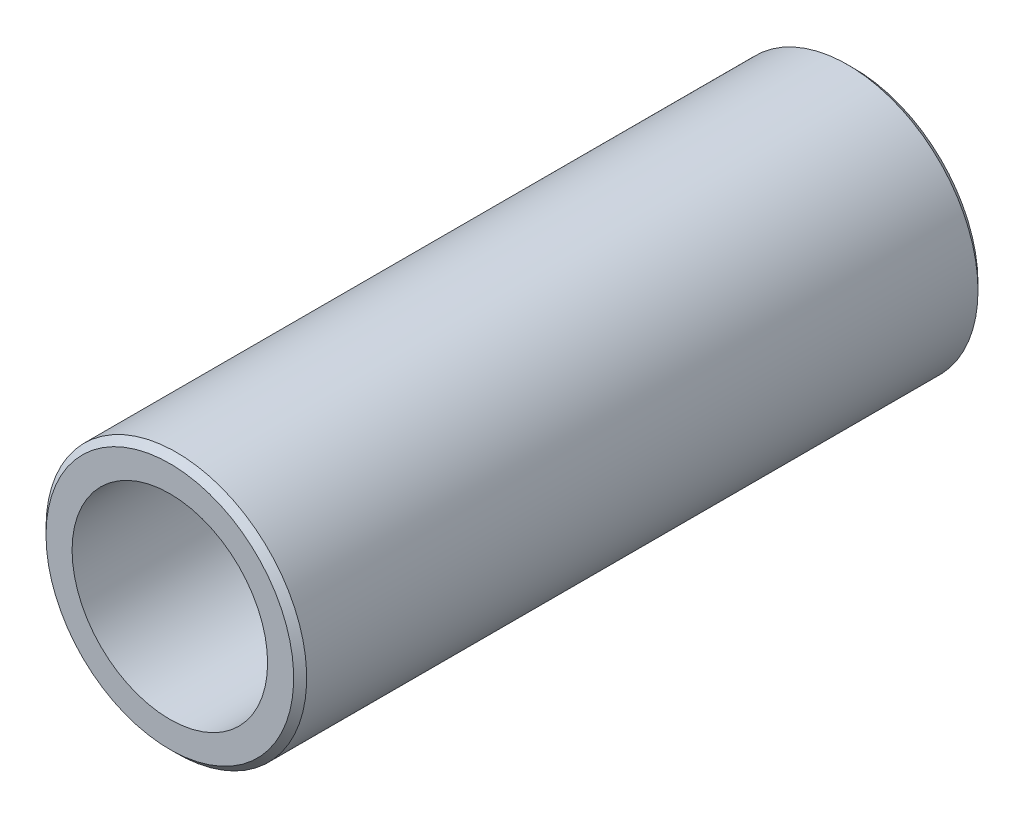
from build123d import *

# Parameters (mm, degrees)
ESQUISSE1_R        = 20
ESQUISSE1_R_2      = 15
EXTRU_MINCE1_DEPTH = 105
CHANFREIN1_SIZE    = 1


with BuildPart() as part:
    # Esquisse1 → Extru.-Mince1 (new body)
    with BuildSketch(Plane.XY):
        Circle(ESQUISSE1_R)
        Circle(ESQUISSE1_R_2, mode=Mode.SUBTRACT)
    extrude(amount=EXTRU_MINCE1_DEPTH)

    # Chanfrein1
    chanfrein1_edges = [part.edges().sort_by_distance(p)[0] for p in [
        (-20, 0, 0),
        (-20, 0, 105),
    ]]
    chamfer(chanfrein1_edges, length=CHANFREIN1_SIZE)


solid = part.part
